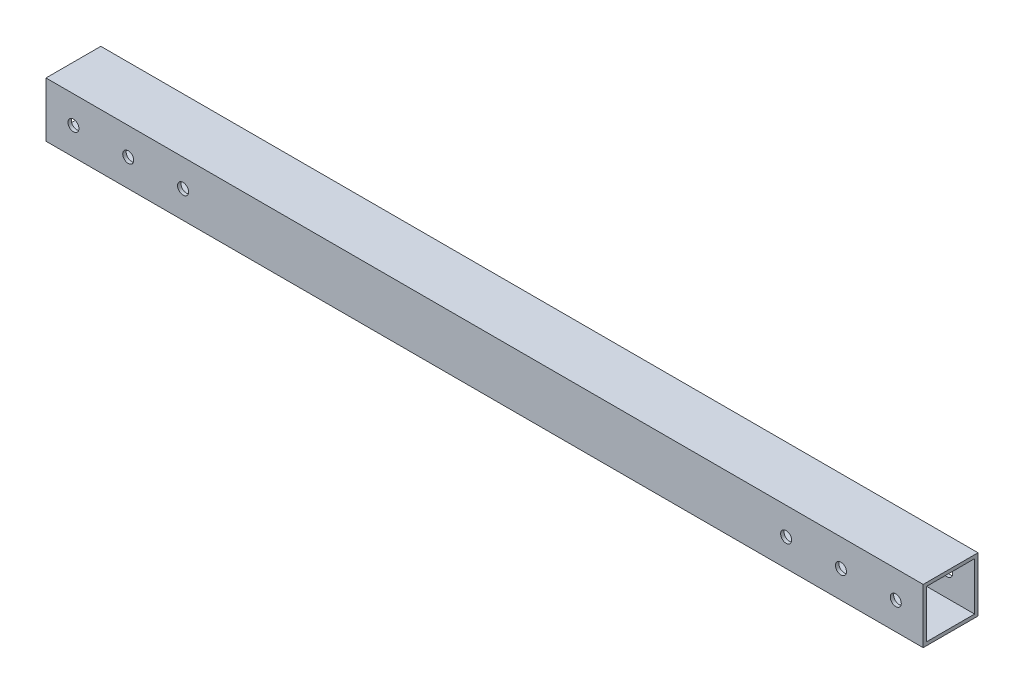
ISO-10303-21;
HEADER;
FILE_DESCRIPTION(('STEP AP214'),'2;1');
FILE_NAME('part.step','',(''),(''),'','','');
FILE_SCHEMA(('AUTOMOTIVE_DESIGN { 1 0 10303 214 1 1 1 1 }'));
ENDSEC;
DATA;
#1=APPLICATION_CONTEXT('core data for automotive mechanical design processes');
#2=APPLICATION_PROTOCOL_DEFINITION('international standard','automotive_design',2000,#1);
#3=PRODUCT_CONTEXT('',#1,'mechanical');
#4=PRODUCT('Part','Part','',(#3));
#5=PRODUCT_RELATED_PRODUCT_CATEGORY('part','',(#4));
#6=PRODUCT_DEFINITION_FORMATION('','',#4);
#7=PRODUCT_DEFINITION_CONTEXT('part definition',#1,'design');
#8=PRODUCT_DEFINITION('design','',#6,#7);
#9=PRODUCT_DEFINITION_SHAPE('','',#8);
#10=(LENGTH_UNIT() NAMED_UNIT(*) SI_UNIT(.MILLI.,.METRE.));
#11=(NAMED_UNIT(*) PLANE_ANGLE_UNIT() SI_UNIT($,.RADIAN.));
#12=(NAMED_UNIT(*) SI_UNIT($,.STERADIAN.) SOLID_ANGLE_UNIT());
#13=UNCERTAINTY_MEASURE_WITH_UNIT(LENGTH_MEASURE(1.E-05),#10,'distance_accuracy_value','');
#14=(GEOMETRIC_REPRESENTATION_CONTEXT(3) GLOBAL_UNCERTAINTY_ASSIGNED_CONTEXT((#13)) GLOBAL_UNIT_ASSIGNED_CONTEXT((#10,
#11,#12)) REPRESENTATION_CONTEXT('',''));
#15=CARTESIAN_POINT('',(0.,0.,0.));
#16=DIRECTION('',(0.,0.,1.));
#17=DIRECTION('',(1.,0.,0.));
#18=AXIS2_PLACEMENT_3D('',#15,#16,#17);
#19=CARTESIAN_POINT('',(-203.2,-12.7,-12.7));
#20=DIRECTION('',(0.,0.,-1.));
#21=DIRECTION('',(-1.,0.,0.));
#22=AXIS2_PLACEMENT_3D('',#19,#20,#21);
#23=PLANE('',#22);
#24=CARTESIAN_POINT('',(190.5,0.,-12.7));
#25=DIRECTION('',(0.,0.,1.));
#26=DIRECTION('',(1.,0.,0.));
#27=AXIS2_PLACEMENT_3D('',#24,#25,#26);
#28=CIRCLE('',#27,2.55269999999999);
#29=CARTESIAN_POINT('',(193.0527,0.,-12.7));
#30=VERTEX_POINT('',#29);
#31=EDGE_CURVE('E259',#30,#30,#28,.T.);
#32=ORIENTED_EDGE('',*,*,#31,.T.);
#33=EDGE_LOOP('',(#32));
#34=FACE_BOUND('',#33,.T.);
#35=CARTESIAN_POINT('',(165.1,-1.77367252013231E-13,-12.7));
#36=DIRECTION('',(0.,0.,1.));
#37=DIRECTION('',(1.,0.,0.));
#38=AXIS2_PLACEMENT_3D('',#35,#36,#37);
#39=CIRCLE('',#38,2.55269999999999);
#40=CARTESIAN_POINT('',(167.6527,-1.77367252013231E-13,-12.7));
#41=VERTEX_POINT('',#40);
#42=EDGE_CURVE('E184',#41,#41,#39,.T.);
#43=ORIENTED_EDGE('',*,*,#42,.T.);
#44=EDGE_LOOP('',(#43));
#45=FACE_BOUND('',#44,.T.);
#46=CARTESIAN_POINT('',(139.7,-3.54734504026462E-13,-12.7));
#47=DIRECTION('',(0.,0.,1.));
#48=DIRECTION('',(1.,0.,0.));
#49=AXIS2_PLACEMENT_3D('',#46,#47,#48);
#50=CIRCLE('',#49,2.55269999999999);
#51=CARTESIAN_POINT('',(142.2527,-3.54734504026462E-13,-12.7));
#52=VERTEX_POINT('',#51);
#53=EDGE_CURVE('E180',#52,#52,#50,.T.);
#54=ORIENTED_EDGE('',*,*,#53,.T.);
#55=EDGE_LOOP('',(#54));
#56=FACE_BOUND('',#55,.T.);
#57=CARTESIAN_POINT('',(-139.7,-2.30577427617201E-12,-12.7));
#58=DIRECTION('',(0.,0.,1.));
#59=DIRECTION('',(1.,0.,0.));
#60=AXIS2_PLACEMENT_3D('',#57,#58,#59);
#61=CIRCLE('',#60,2.55269999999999);
#62=CARTESIAN_POINT('',(-137.1473,-2.30577427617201E-12,-12.7));
#63=VERTEX_POINT('',#62);
#64=EDGE_CURVE('E176',#63,#63,#61,.T.);
#65=ORIENTED_EDGE('',*,*,#64,.T.);
#66=EDGE_LOOP('',(#65));
#67=FACE_BOUND('',#66,.T.);
#68=CARTESIAN_POINT('',(-165.1,-2.48314152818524E-12,-12.7));
#69=DIRECTION('',(0.,0.,1.));
#70=DIRECTION('',(1.,0.,0.));
#71=AXIS2_PLACEMENT_3D('',#68,#69,#70);
#72=CIRCLE('',#71,2.55269999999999);
#73=CARTESIAN_POINT('',(-162.5473,-2.48314152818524E-12,-12.7));
#74=VERTEX_POINT('',#73);
#75=EDGE_CURVE('E171',#74,#74,#72,.T.);
#76=ORIENTED_EDGE('',*,*,#75,.T.);
#77=EDGE_LOOP('',(#76));
#78=FACE_BOUND('',#77,.T.);
#79=CARTESIAN_POINT('',(-190.5,-2.66050878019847E-12,-12.7));
#80=DIRECTION('',(0.,0.,1.));
#81=DIRECTION('',(1.,0.,0.));
#82=AXIS2_PLACEMENT_3D('',#79,#80,#81);
#83=CIRCLE('',#82,2.55269999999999);
#84=CARTESIAN_POINT('',(-187.9473,-2.66050878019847E-12,-12.7));
#85=VERTEX_POINT('',#84);
#86=EDGE_CURVE('E223',#85,#85,#83,.T.);
#87=ORIENTED_EDGE('',*,*,#86,.T.);
#88=EDGE_LOOP('',(#87));
#89=FACE_BOUND('',#88,.T.);
#90=DIRECTION('',(1.,0.,0.));
#91=VECTOR('',#90,1.);
#92=CARTESIAN_POINT('',(-203.2,12.7,-12.7));
#93=LINE('',#92,#91);
#94=CARTESIAN_POINT('',(-203.2,12.7,-12.7));
#95=VERTEX_POINT('',#94);
#96=CARTESIAN_POINT('',(203.2,12.7,-12.7));
#97=VERTEX_POINT('',#96);
#98=EDGE_CURVE('E161',#95,#97,#93,.T.);
#99=ORIENTED_EDGE('',*,*,#98,.T.);
#100=DIRECTION('',(0.,1.,0.));
#101=VECTOR('',#100,1.);
#102=CARTESIAN_POINT('',(203.2,-12.7,-12.7));
#103=LINE('',#102,#101);
#104=CARTESIAN_POINT('',(203.2,-12.7,-12.7));
#105=VERTEX_POINT('',#104);
#106=EDGE_CURVE('E129',#105,#97,#103,.T.);
#107=ORIENTED_EDGE('',*,*,#106,.F.);
#108=DIRECTION('',(1.,0.,0.));
#109=VECTOR('',#108,1.);
#110=CARTESIAN_POINT('',(-203.2,-12.7,-12.7));
#111=LINE('',#110,#109);
#112=CARTESIAN_POINT('',(-203.2,-12.7,-12.7));
#113=VERTEX_POINT('',#112);
#114=EDGE_CURVE('E11',#113,#105,#111,.T.);
#115=ORIENTED_EDGE('',*,*,#114,.F.);
#116=DIRECTION('',(0.,1.,0.));
#117=VECTOR('',#116,1.);
#118=CARTESIAN_POINT('',(-203.2,-12.7,-12.7));
#119=LINE('',#118,#117);
#120=EDGE_CURVE('E148',#113,#95,#119,.T.);
#121=ORIENTED_EDGE('',*,*,#120,.T.);
#122=EDGE_LOOP('',(#99,#107,#115,#121));
#123=FACE_BOUND('',#122,.T.);
#124=ADVANCED_FACE('F32',(#34,#45,#56,#67,#78,#89,#123),#23,.T.);
#125=CARTESIAN_POINT('',(-203.2,-12.7,12.7));
#126=DIRECTION('',(0.,-1.,0.));
#127=DIRECTION('',(0.,0.,-1.));
#128=AXIS2_PLACEMENT_3D('',#125,#126,#127);
#129=PLANE('',#128);
#130=ORIENTED_EDGE('',*,*,#114,.T.);
#131=DIRECTION('',(0.,0.,-1.));
#132=VECTOR('',#131,1.);
#133=CARTESIAN_POINT('',(203.2,-12.7,12.7));
#134=LINE('',#133,#132);
#135=CARTESIAN_POINT('',(203.2,-12.7,12.7));
#136=VERTEX_POINT('',#135);
#137=EDGE_CURVE('E138',#136,#105,#134,.T.);
#138=ORIENTED_EDGE('',*,*,#137,.F.);
#139=DIRECTION('',(1.,0.,0.));
#140=VECTOR('',#139,1.);
#141=CARTESIAN_POINT('',(-203.2,-12.7,12.7));
#142=LINE('',#141,#140);
#143=CARTESIAN_POINT('',(-203.2,-12.7,12.7));
#144=VERTEX_POINT('',#143);
#145=EDGE_CURVE('E40',#144,#136,#142,.T.);
#146=ORIENTED_EDGE('',*,*,#145,.F.);
#147=DIRECTION('',(0.,0.,-1.));
#148=VECTOR('',#147,1.);
#149=CARTESIAN_POINT('',(-203.2,-12.7,12.7));
#150=LINE('',#149,#148);
#151=EDGE_CURVE('E159',#144,#113,#150,.T.);
#152=ORIENTED_EDGE('',*,*,#151,.T.);
#153=EDGE_LOOP('',(#130,#138,#146,#152));
#154=FACE_BOUND('',#153,.T.);
#155=ADVANCED_FACE('F249',(#154),#129,.T.);
#156=CARTESIAN_POINT('',(-203.2,-12.7,12.7));
#157=DIRECTION('',(0.,0.,1.));
#158=DIRECTION('',(1.,0.,0.));
#159=AXIS2_PLACEMENT_3D('',#156,#157,#158);
#160=PLANE('',#159);
#161=CARTESIAN_POINT('',(190.5,0.,12.7));
#162=DIRECTION('',(0.,0.,1.));
#163=DIRECTION('',(1.,0.,0.));
#164=AXIS2_PLACEMENT_3D('',#161,#162,#163);
#165=CIRCLE('',#164,2.55269999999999);
#166=CARTESIAN_POINT('',(193.0527,0.,12.7));
#167=VERTEX_POINT('',#166);
#168=EDGE_CURVE('E420',#167,#167,#165,.T.);
#169=ORIENTED_EDGE('',*,*,#168,.F.);
#170=EDGE_LOOP('',(#169));
#171=FACE_BOUND('',#170,.T.);
#172=CARTESIAN_POINT('',(165.1,-1.77367252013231E-13,12.7));
#173=DIRECTION('',(0.,0.,1.));
#174=DIRECTION('',(1.,0.,0.));
#175=AXIS2_PLACEMENT_3D('',#172,#173,#174);
#176=CIRCLE('',#175,2.55269999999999);
#177=CARTESIAN_POINT('',(167.6527,-1.77367252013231E-13,12.7));
#178=VERTEX_POINT('',#177);
#179=EDGE_CURVE('E191',#178,#178,#176,.T.);
#180=ORIENTED_EDGE('',*,*,#179,.F.);
#181=EDGE_LOOP('',(#180));
#182=FACE_BOUND('',#181,.T.);
#183=CARTESIAN_POINT('',(139.7,-3.54734504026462E-13,12.7));
#184=DIRECTION('',(0.,0.,1.));
#185=DIRECTION('',(1.,0.,0.));
#186=AXIS2_PLACEMENT_3D('',#183,#184,#185);
#187=CIRCLE('',#186,2.55269999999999);
#188=CARTESIAN_POINT('',(142.2527,-3.54734504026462E-13,12.7));
#189=VERTEX_POINT('',#188);
#190=EDGE_CURVE('E188',#189,#189,#187,.T.);
#191=ORIENTED_EDGE('',*,*,#190,.F.);
#192=EDGE_LOOP('',(#191));
#193=FACE_BOUND('',#192,.T.);
#194=CARTESIAN_POINT('',(-139.7,-2.30577427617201E-12,12.7));
#195=DIRECTION('',(0.,0.,1.));
#196=DIRECTION('',(1.,0.,0.));
#197=AXIS2_PLACEMENT_3D('',#194,#195,#196);
#198=CIRCLE('',#197,2.55269999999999);
#199=CARTESIAN_POINT('',(-137.1473,-2.30577427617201E-12,12.7));
#200=VERTEX_POINT('',#199);
#201=EDGE_CURVE('E206',#200,#200,#198,.T.);
#202=ORIENTED_EDGE('',*,*,#201,.F.);
#203=EDGE_LOOP('',(#202));
#204=FACE_BOUND('',#203,.T.);
#205=CARTESIAN_POINT('',(-165.1,-2.48314152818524E-12,12.7));
#206=DIRECTION('',(0.,0.,1.));
#207=DIRECTION('',(1.,0.,0.));
#208=AXIS2_PLACEMENT_3D('',#205,#206,#207);
#209=CIRCLE('',#208,2.55269999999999);
#210=CARTESIAN_POINT('',(-162.5473,-2.48314152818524E-12,12.7));
#211=VERTEX_POINT('',#210);
#212=EDGE_CURVE('E213',#211,#211,#209,.T.);
#213=ORIENTED_EDGE('',*,*,#212,.F.);
#214=EDGE_LOOP('',(#213));
#215=FACE_BOUND('',#214,.T.);
#216=CARTESIAN_POINT('',(-190.5,-2.66050878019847E-12,12.7));
#217=DIRECTION('',(0.,0.,1.));
#218=DIRECTION('',(1.,0.,0.));
#219=AXIS2_PLACEMENT_3D('',#216,#217,#218);
#220=CIRCLE('',#219,2.55269999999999);
#221=CARTESIAN_POINT('',(-187.9473,-2.66050878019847E-12,12.7));
#222=VERTEX_POINT('',#221);
#223=EDGE_CURVE('E220',#222,#222,#220,.T.);
#224=ORIENTED_EDGE('',*,*,#223,.F.);
#225=EDGE_LOOP('',(#224));
#226=FACE_BOUND('',#225,.T.);
#227=ORIENTED_EDGE('',*,*,#145,.T.);
#228=DIRECTION('',(0.,-1.,0.));
#229=VECTOR('',#228,1.);
#230=CARTESIAN_POINT('',(203.2,-12.7,12.7));
#231=LINE('',#230,#229);
#232=CARTESIAN_POINT('',(203.2,12.7,12.7));
#233=VERTEX_POINT('',#232);
#234=EDGE_CURVE('E135',#233,#136,#231,.T.);
#235=ORIENTED_EDGE('',*,*,#234,.F.);
#236=DIRECTION('',(1.,0.,0.));
#237=VECTOR('',#236,1.);
#238=CARTESIAN_POINT('',(-203.2,12.7,12.7));
#239=LINE('',#238,#237);
#240=CARTESIAN_POINT('',(-203.2,12.7,12.7));
#241=VERTEX_POINT('',#240);
#242=EDGE_CURVE('E164',#241,#233,#239,.T.);
#243=ORIENTED_EDGE('',*,*,#242,.F.);
#244=DIRECTION('',(0.,-1.,0.));
#245=VECTOR('',#244,1.);
#246=CARTESIAN_POINT('',(-203.2,-12.7,12.7));
#247=LINE('',#246,#245);
#248=EDGE_CURVE('E156',#241,#144,#247,.T.);
#249=ORIENTED_EDGE('',*,*,#248,.T.);
#250=EDGE_LOOP('',(#227,#235,#243,#249));
#251=FACE_BOUND('',#250,.T.);
#252=ADVANCED_FACE('F254',(#171,#182,#193,#204,#215,#226,#251),#160,.T.);
#253=CARTESIAN_POINT('',(-203.2,12.7,12.7));
#254=DIRECTION('',(0.,1.,0.));
#255=DIRECTION('',(0.,0.,1.));
#256=AXIS2_PLACEMENT_3D('',#253,#254,#255);
#257=PLANE('',#256);
#258=ORIENTED_EDGE('',*,*,#242,.T.);
#259=DIRECTION('',(0.,0.,1.));
#260=VECTOR('',#259,1.);
#261=CARTESIAN_POINT('',(203.2,12.7,12.7));
#262=LINE('',#261,#260);
#263=EDGE_CURVE('E132',#97,#233,#262,.T.);
#264=ORIENTED_EDGE('',*,*,#263,.F.);
#265=ORIENTED_EDGE('',*,*,#98,.F.);
#266=DIRECTION('',(0.,0.,1.));
#267=VECTOR('',#266,1.);
#268=CARTESIAN_POINT('',(-203.2,12.7,12.7));
#269=LINE('',#268,#267);
#270=EDGE_CURVE('E153',#95,#241,#269,.T.);
#271=ORIENTED_EDGE('',*,*,#270,.T.);
#272=EDGE_LOOP('',(#258,#264,#265,#271));
#273=FACE_BOUND('',#272,.T.);
#274=ADVANCED_FACE('F270',(#273),#257,.T.);
#275=CARTESIAN_POINT('',(-203.2,0.,0.));
#276=DIRECTION('',(-1.,0.,0.));
#277=DIRECTION('',(0.,0.,1.));
#278=AXIS2_PLACEMENT_3D('',#275,#276,#277);
#279=PLANE('',#278);
#280=DIRECTION('',(0.,1.,0.));
#281=VECTOR('',#280,1.);
#282=CARTESIAN_POINT('',(-203.2,-11.1125,-11.1125));
#283=LINE('',#282,#281);
#284=CARTESIAN_POINT('',(-203.2,-11.1125,-11.1125));
#285=VERTEX_POINT('',#284);
#286=CARTESIAN_POINT('',(-203.2,11.1125,-11.1125));
#287=VERTEX_POINT('',#286);
#288=EDGE_CURVE('E141',#285,#287,#283,.T.);
#289=ORIENTED_EDGE('',*,*,#288,.T.);
#290=DIRECTION('',(0.,0.,1.));
#291=VECTOR('',#290,1.);
#292=CARTESIAN_POINT('',(-203.2,11.1125,11.1125));
#293=LINE('',#292,#291);
#294=CARTESIAN_POINT('',(-203.2,11.1125,11.1125));
#295=VERTEX_POINT('',#294);
#296=EDGE_CURVE('E104',#287,#295,#293,.T.);
#297=ORIENTED_EDGE('',*,*,#296,.T.);
#298=DIRECTION('',(0.,-1.,0.));
#299=VECTOR('',#298,1.);
#300=CARTESIAN_POINT('',(-203.2,-11.1125,11.1125));
#301=LINE('',#300,#299);
#302=CARTESIAN_POINT('',(-203.2,-11.1125,11.1125));
#303=VERTEX_POINT('',#302);
#304=EDGE_CURVE('E48',#295,#303,#301,.T.);
#305=ORIENTED_EDGE('',*,*,#304,.T.);
#306=DIRECTION('',(0.,0.,-1.));
#307=VECTOR('',#306,1.);
#308=CARTESIAN_POINT('',(-203.2,-11.1125,11.1125));
#309=LINE('',#308,#307);
#310=EDGE_CURVE('E109',#303,#285,#309,.T.);
#311=ORIENTED_EDGE('',*,*,#310,.T.);
#312=EDGE_LOOP('',(#289,#297,#305,#311));
#313=FACE_BOUND('',#312,.T.);
#314=ORIENTED_EDGE('',*,*,#120,.F.);
#315=ORIENTED_EDGE('',*,*,#151,.F.);
#316=ORIENTED_EDGE('',*,*,#248,.F.);
#317=ORIENTED_EDGE('',*,*,#270,.F.);
#318=EDGE_LOOP('',(#314,#315,#316,#317));
#319=FACE_BOUND('',#318,.T.);
#320=ADVANCED_FACE('F277',(#313,#319),#279,.T.);
#321=CARTESIAN_POINT('',(-203.2,-11.1125,-11.1125));
#322=DIRECTION('',(0.,0.,-1.));
#323=DIRECTION('',(-1.,0.,0.));
#324=AXIS2_PLACEMENT_3D('',#321,#322,#323);
#325=PLANE('',#324);
#326=CARTESIAN_POINT('',(190.5,0.,-11.1125));
#327=DIRECTION('',(0.,0.,-1.));
#328=DIRECTION('',(-1.,0.,0.));
#329=AXIS2_PLACEMENT_3D('',#326,#327,#328);
#330=CIRCLE('',#329,2.55269999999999);
#331=CARTESIAN_POINT('',(187.9473,0.,-11.1125));
#332=VERTEX_POINT('',#331);
#333=EDGE_CURVE('E196',#332,#332,#330,.T.);
#334=ORIENTED_EDGE('',*,*,#333,.T.);
#335=EDGE_LOOP('',(#334));
#336=FACE_BOUND('',#335,.T.);
#337=CARTESIAN_POINT('',(165.1,-1.77367252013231E-13,-11.1125));
#338=DIRECTION('',(0.,0.,-1.));
#339=DIRECTION('',(-1.,0.,0.));
#340=AXIS2_PLACEMENT_3D('',#337,#338,#339);
#341=CIRCLE('',#340,2.55269999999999);
#342=CARTESIAN_POINT('',(162.5473,-1.77367252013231E-13,-11.1125));
#343=VERTEX_POINT('',#342);
#344=EDGE_CURVE('E181',#343,#343,#341,.T.);
#345=ORIENTED_EDGE('',*,*,#344,.T.);
#346=EDGE_LOOP('',(#345));
#347=FACE_BOUND('',#346,.T.);
#348=CARTESIAN_POINT('',(139.7,-3.54734504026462E-13,-11.1125));
#349=DIRECTION('',(0.,0.,-1.));
#350=DIRECTION('',(-1.,0.,0.));
#351=AXIS2_PLACEMENT_3D('',#348,#349,#350);
#352=CIRCLE('',#351,2.55269999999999);
#353=CARTESIAN_POINT('',(137.1473,-3.54734504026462E-13,-11.1125));
#354=VERTEX_POINT('',#353);
#355=EDGE_CURVE('E179',#354,#354,#352,.T.);
#356=ORIENTED_EDGE('',*,*,#355,.T.);
#357=EDGE_LOOP('',(#356));
#358=FACE_BOUND('',#357,.T.);
#359=CARTESIAN_POINT('',(-139.7,-2.30577427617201E-12,-11.1125));
#360=DIRECTION('',(0.,0.,-1.));
#361=DIRECTION('',(-1.,0.,0.));
#362=AXIS2_PLACEMENT_3D('',#359,#360,#361);
#363=CIRCLE('',#362,2.55269999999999);
#364=CARTESIAN_POINT('',(-142.2527,-2.30577427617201E-12,-11.1125));
#365=VERTEX_POINT('',#364);
#366=EDGE_CURVE('E172',#365,#365,#363,.T.);
#367=ORIENTED_EDGE('',*,*,#366,.T.);
#368=EDGE_LOOP('',(#367));
#369=FACE_BOUND('',#368,.T.);
#370=CARTESIAN_POINT('',(-165.1,-2.48314152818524E-12,-11.1125));
#371=DIRECTION('',(0.,0.,-1.));
#372=DIRECTION('',(-1.,0.,0.));
#373=AXIS2_PLACEMENT_3D('',#370,#371,#372);
#374=CIRCLE('',#373,2.55269999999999);
#375=CARTESIAN_POINT('',(-167.6527,-2.48314152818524E-12,-11.1125));
#376=VERTEX_POINT('',#375);
#377=EDGE_CURVE('E170',#376,#376,#374,.T.);
#378=ORIENTED_EDGE('',*,*,#377,.T.);
#379=EDGE_LOOP('',(#378));
#380=FACE_BOUND('',#379,.T.);
#381=CARTESIAN_POINT('',(-190.5,-2.66050878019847E-12,-11.1125));
#382=DIRECTION('',(0.,0.,-1.));
#383=DIRECTION('',(-1.,0.,0.));
#384=AXIS2_PLACEMENT_3D('',#381,#382,#383);
#385=CIRCLE('',#384,2.55269999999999);
#386=CARTESIAN_POINT('',(-193.0527,-2.66050878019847E-12,-11.1125));
#387=VERTEX_POINT('',#386);
#388=EDGE_CURVE('E118',#387,#387,#385,.T.);
#389=ORIENTED_EDGE('',*,*,#388,.T.);
#390=EDGE_LOOP('',(#389));
#391=FACE_BOUND('',#390,.T.);
#392=DIRECTION('',(1.,0.,0.));
#393=VECTOR('',#392,1.);
#394=CARTESIAN_POINT('',(-203.2,-11.1125,-11.1125));
#395=LINE('',#394,#393);
#396=CARTESIAN_POINT('',(203.2,-11.1125,-11.1125));
#397=VERTEX_POINT('',#396);
#398=EDGE_CURVE('E114',#285,#397,#395,.T.);
#399=ORIENTED_EDGE('',*,*,#398,.T.);
#400=DIRECTION('',(0.,1.,0.));
#401=VECTOR('',#400,1.);
#402=CARTESIAN_POINT('',(203.2,-11.1125,-11.1125));
#403=LINE('',#402,#401);
#404=CARTESIAN_POINT('',(203.2,11.1125,-11.1125));
#405=VERTEX_POINT('',#404);
#406=EDGE_CURVE('E112',#397,#405,#403,.T.);
#407=ORIENTED_EDGE('',*,*,#406,.T.);
#408=DIRECTION('',(1.,0.,0.));
#409=VECTOR('',#408,1.);
#410=CARTESIAN_POINT('',(-203.2,11.1125,-11.1125));
#411=LINE('',#410,#409);
#412=EDGE_CURVE('E97',#287,#405,#411,.T.);
#413=ORIENTED_EDGE('',*,*,#412,.F.);
#414=ORIENTED_EDGE('',*,*,#288,.F.);
#415=EDGE_LOOP('',(#399,#407,#413,#414));
#416=FACE_BOUND('',#415,.T.);
#417=ADVANCED_FACE('F113',(#336,#347,#358,#369,#380,#391,#416),#325,.F.);
#418=CARTESIAN_POINT('',(-203.2,-11.1125,11.1125));
#419=DIRECTION('',(0.,-1.,0.));
#420=DIRECTION('',(0.,0.,-1.));
#421=AXIS2_PLACEMENT_3D('',#418,#419,#420);
#422=PLANE('',#421);
#423=DIRECTION('',(1.,0.,0.));
#424=VECTOR('',#423,1.);
#425=CARTESIAN_POINT('',(-203.2,-11.1125,11.1125));
#426=LINE('',#425,#424);
#427=CARTESIAN_POINT('',(203.2,-11.1125,11.1125));
#428=VERTEX_POINT('',#427);
#429=EDGE_CURVE('E149',#303,#428,#426,.T.);
#430=ORIENTED_EDGE('',*,*,#429,.T.);
#431=DIRECTION('',(0.,0.,-1.));
#432=VECTOR('',#431,1.);
#433=CARTESIAN_POINT('',(203.2,-11.1125,11.1125));
#434=LINE('',#433,#432);
#435=EDGE_CURVE('E124',#428,#397,#434,.T.);
#436=ORIENTED_EDGE('',*,*,#435,.T.);
#437=ORIENTED_EDGE('',*,*,#398,.F.);
#438=ORIENTED_EDGE('',*,*,#310,.F.);
#439=EDGE_LOOP('',(#430,#436,#437,#438));
#440=FACE_BOUND('',#439,.T.);
#441=ADVANCED_FACE('F293',(#440),#422,.F.);
#442=CARTESIAN_POINT('',(-203.2,-11.1125,11.1125));
#443=DIRECTION('',(0.,0.,1.));
#444=DIRECTION('',(1.,0.,0.));
#445=AXIS2_PLACEMENT_3D('',#442,#443,#444);
#446=PLANE('',#445);
#447=CARTESIAN_POINT('',(190.5,0.,11.1125));
#448=DIRECTION('',(0.,0.,1.));
#449=DIRECTION('',(1.,0.,0.));
#450=AXIS2_PLACEMENT_3D('',#447,#448,#449);
#451=CIRCLE('',#450,2.55269999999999);
#452=CARTESIAN_POINT('',(193.0527,0.,11.1125));
#453=VERTEX_POINT('',#452);
#454=EDGE_CURVE('E35',#453,#453,#451,.T.);
#455=ORIENTED_EDGE('',*,*,#454,.T.);
#456=EDGE_LOOP('',(#455));
#457=FACE_BOUND('',#456,.T.);
#458=CARTESIAN_POINT('',(165.1,-1.77367252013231E-13,11.1125));
#459=DIRECTION('',(0.,0.,1.));
#460=DIRECTION('',(1.,0.,0.));
#461=AXIS2_PLACEMENT_3D('',#458,#459,#460);
#462=CIRCLE('',#461,2.55269999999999);
#463=CARTESIAN_POINT('',(167.6527,-1.77367252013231E-13,11.1125));
#464=VERTEX_POINT('',#463);
#465=EDGE_CURVE('E183',#464,#464,#462,.T.);
#466=ORIENTED_EDGE('',*,*,#465,.T.);
#467=EDGE_LOOP('',(#466));
#468=FACE_BOUND('',#467,.T.);
#469=CARTESIAN_POINT('',(139.7,-3.54734504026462E-13,11.1125));
#470=DIRECTION('',(0.,0.,1.));
#471=DIRECTION('',(1.,0.,0.));
#472=AXIS2_PLACEMENT_3D('',#469,#470,#471);
#473=CIRCLE('',#472,2.55269999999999);
#474=CARTESIAN_POINT('',(142.2527,-3.54734504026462E-13,11.1125));
#475=VERTEX_POINT('',#474);
#476=EDGE_CURVE('E177',#475,#475,#473,.T.);
#477=ORIENTED_EDGE('',*,*,#476,.T.);
#478=EDGE_LOOP('',(#477));
#479=FACE_BOUND('',#478,.T.);
#480=CARTESIAN_POINT('',(-139.7,-2.30577427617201E-12,11.1125));
#481=DIRECTION('',(0.,0.,1.));
#482=DIRECTION('',(1.,0.,0.));
#483=AXIS2_PLACEMENT_3D('',#480,#481,#482);
#484=CIRCLE('',#483,2.55269999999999);
#485=CARTESIAN_POINT('',(-137.1473,-2.30577427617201E-12,11.1125));
#486=VERTEX_POINT('',#485);
#487=EDGE_CURVE('E175',#486,#486,#484,.T.);
#488=ORIENTED_EDGE('',*,*,#487,.T.);
#489=EDGE_LOOP('',(#488));
#490=FACE_BOUND('',#489,.T.);
#491=CARTESIAN_POINT('',(-165.1,-2.48314152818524E-12,11.1125));
#492=DIRECTION('',(0.,0.,1.));
#493=DIRECTION('',(1.,0.,0.));
#494=AXIS2_PLACEMENT_3D('',#491,#492,#493);
#495=CIRCLE('',#494,2.55269999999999);
#496=CARTESIAN_POINT('',(-162.5473,-2.48314152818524E-12,11.1125));
#497=VERTEX_POINT('',#496);
#498=EDGE_CURVE('E167',#497,#497,#495,.T.);
#499=ORIENTED_EDGE('',*,*,#498,.T.);
#500=EDGE_LOOP('',(#499));
#501=FACE_BOUND('',#500,.T.);
#502=CARTESIAN_POINT('',(-190.5,-2.66050878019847E-12,11.1125));
#503=DIRECTION('',(0.,0.,1.));
#504=DIRECTION('',(1.,0.,0.));
#505=AXIS2_PLACEMENT_3D('',#502,#503,#504);
#506=CIRCLE('',#505,2.55269999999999);
#507=CARTESIAN_POINT('',(-187.9473,-2.66050878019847E-12,11.1125));
#508=VERTEX_POINT('',#507);
#509=EDGE_CURVE('E226',#508,#508,#506,.T.);
#510=ORIENTED_EDGE('',*,*,#509,.T.);
#511=EDGE_LOOP('',(#510));
#512=FACE_BOUND('',#511,.T.);
#513=DIRECTION('',(1.,0.,0.));
#514=VECTOR('',#513,1.);
#515=CARTESIAN_POINT('',(-203.2,11.1125,11.1125));
#516=LINE('',#515,#514);
#517=CARTESIAN_POINT('',(203.2,11.1125,11.1125));
#518=VERTEX_POINT('',#517);
#519=EDGE_CURVE('E108',#295,#518,#516,.T.);
#520=ORIENTED_EDGE('',*,*,#519,.T.);
#521=DIRECTION('',(0.,-1.,0.));
#522=VECTOR('',#521,1.);
#523=CARTESIAN_POINT('',(203.2,-11.1125,11.1125));
#524=LINE('',#523,#522);
#525=EDGE_CURVE('E122',#518,#428,#524,.T.);
#526=ORIENTED_EDGE('',*,*,#525,.T.);
#527=ORIENTED_EDGE('',*,*,#429,.F.);
#528=ORIENTED_EDGE('',*,*,#304,.F.);
#529=EDGE_LOOP('',(#520,#526,#527,#528));
#530=FACE_BOUND('',#529,.T.);
#531=ADVANCED_FACE('F297',(#457,#468,#479,#490,#501,#512,#530),#446,.F.);
#532=CARTESIAN_POINT('',(-203.2,11.1125,11.1125));
#533=DIRECTION('',(0.,1.,0.));
#534=DIRECTION('',(0.,0.,1.));
#535=AXIS2_PLACEMENT_3D('',#532,#533,#534);
#536=PLANE('',#535);
#537=ORIENTED_EDGE('',*,*,#412,.T.);
#538=DIRECTION('',(0.,0.,1.));
#539=VECTOR('',#538,1.);
#540=CARTESIAN_POINT('',(203.2,11.1125,11.1125));
#541=LINE('',#540,#539);
#542=EDGE_CURVE('E101',#405,#518,#541,.T.);
#543=ORIENTED_EDGE('',*,*,#542,.T.);
#544=ORIENTED_EDGE('',*,*,#519,.F.);
#545=ORIENTED_EDGE('',*,*,#296,.F.);
#546=EDGE_LOOP('',(#537,#543,#544,#545));
#547=FACE_BOUND('',#546,.T.);
#548=ADVANCED_FACE('F99',(#547),#536,.F.);
#549=CARTESIAN_POINT('',(203.2,0.,0.));
#550=DIRECTION('',(-1.,0.,0.));
#551=DIRECTION('',(0.,0.,1.));
#552=AXIS2_PLACEMENT_3D('',#549,#550,#551);
#553=PLANE('',#552);
#554=ORIENTED_EDGE('',*,*,#106,.T.);
#555=ORIENTED_EDGE('',*,*,#263,.T.);
#556=ORIENTED_EDGE('',*,*,#234,.T.);
#557=ORIENTED_EDGE('',*,*,#137,.T.);
#558=EDGE_LOOP('',(#554,#555,#556,#557));
#559=FACE_BOUND('',#558,.T.);
#560=ORIENTED_EDGE('',*,*,#406,.F.);
#561=ORIENTED_EDGE('',*,*,#435,.F.);
#562=ORIENTED_EDGE('',*,*,#525,.F.);
#563=ORIENTED_EDGE('',*,*,#542,.F.);
#564=EDGE_LOOP('',(#560,#561,#562,#563));
#565=FACE_BOUND('',#564,.T.);
#566=ADVANCED_FACE('F120',(#559,#565),#553,.F.);
#567=CARTESIAN_POINT('',(-190.5,-2.66050878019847E-12,12.7));
#568=DIRECTION('',(0.,0.,1.));
#569=DIRECTION('',(1.,0.,0.));
#570=AXIS2_PLACEMENT_3D('',#567,#568,#569);
#571=CYLINDRICAL_SURFACE('',#570,2.55269999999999);
#572=ORIENTED_EDGE('',*,*,#223,.T.);
#573=EDGE_LOOP('',(#572));
#574=FACE_BOUND('',#573,.T.);
#575=ORIENTED_EDGE('',*,*,#509,.F.);
#576=EDGE_LOOP('',(#575));
#577=FACE_BOUND('',#576,.T.);
#578=ADVANCED_FACE('F235',(#574,#577),#571,.F.);
#579=ORIENTED_EDGE('',*,*,#86,.F.);
#580=EDGE_LOOP('',(#579));
#581=FACE_BOUND('',#580,.T.);
#582=ORIENTED_EDGE('',*,*,#388,.F.);
#583=EDGE_LOOP('',(#582));
#584=FACE_BOUND('',#583,.T.);
#585=ADVANCED_FACE('F232',(#581,#584),#571,.F.);
#586=CARTESIAN_POINT('',(-165.1,-2.48314152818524E-12,12.7));
#587=DIRECTION('',(0.,0.,1.));
#588=DIRECTION('',(1.,0.,0.));
#589=AXIS2_PLACEMENT_3D('',#586,#587,#588);
#590=CYLINDRICAL_SURFACE('',#589,2.55269999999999);
#591=ORIENTED_EDGE('',*,*,#212,.T.);
#592=EDGE_LOOP('',(#591));
#593=FACE_BOUND('',#592,.T.);
#594=ORIENTED_EDGE('',*,*,#498,.F.);
#595=EDGE_LOOP('',(#594));
#596=FACE_BOUND('',#595,.T.);
#597=ADVANCED_FACE('F234',(#593,#596),#590,.F.);
#598=ORIENTED_EDGE('',*,*,#75,.F.);
#599=EDGE_LOOP('',(#598));
#600=FACE_BOUND('',#599,.T.);
#601=ORIENTED_EDGE('',*,*,#377,.F.);
#602=EDGE_LOOP('',(#601));
#603=FACE_BOUND('',#602,.T.);
#604=ADVANCED_FACE('F242',(#600,#603),#590,.F.);
#605=CARTESIAN_POINT('',(-139.7,-2.30577427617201E-12,12.7));
#606=DIRECTION('',(0.,0.,1.));
#607=DIRECTION('',(1.,0.,0.));
#608=AXIS2_PLACEMENT_3D('',#605,#606,#607);
#609=CYLINDRICAL_SURFACE('',#608,2.55269999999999);
#610=ORIENTED_EDGE('',*,*,#64,.F.);
#611=EDGE_LOOP('',(#610));
#612=FACE_BOUND('',#611,.T.);
#613=ORIENTED_EDGE('',*,*,#366,.F.);
#614=EDGE_LOOP('',(#613));
#615=FACE_BOUND('',#614,.T.);
#616=ADVANCED_FACE('F335',(#612,#615),#609,.F.);
#617=ORIENTED_EDGE('',*,*,#201,.T.);
#618=EDGE_LOOP('',(#617));
#619=FACE_BOUND('',#618,.T.);
#620=ORIENTED_EDGE('',*,*,#487,.F.);
#621=EDGE_LOOP('',(#620));
#622=FACE_BOUND('',#621,.T.);
#623=ADVANCED_FACE('F344',(#619,#622),#609,.F.);
#624=CARTESIAN_POINT('',(139.7,-3.54734504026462E-13,12.7));
#625=DIRECTION('',(0.,0.,1.));
#626=DIRECTION('',(1.,0.,0.));
#627=AXIS2_PLACEMENT_3D('',#624,#625,#626);
#628=CYLINDRICAL_SURFACE('',#627,2.55269999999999);
#629=ORIENTED_EDGE('',*,*,#190,.T.);
#630=EDGE_LOOP('',(#629));
#631=FACE_BOUND('',#630,.T.);
#632=ORIENTED_EDGE('',*,*,#476,.F.);
#633=EDGE_LOOP('',(#632));
#634=FACE_BOUND('',#633,.T.);
#635=ADVANCED_FACE('F354',(#631,#634),#628,.F.);
#636=ORIENTED_EDGE('',*,*,#53,.F.);
#637=EDGE_LOOP('',(#636));
#638=FACE_BOUND('',#637,.T.);
#639=ORIENTED_EDGE('',*,*,#355,.F.);
#640=EDGE_LOOP('',(#639));
#641=FACE_BOUND('',#640,.T.);
#642=ADVANCED_FACE('F363',(#638,#641),#628,.F.);
#643=CARTESIAN_POINT('',(165.1,-1.77367252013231E-13,12.7));
#644=DIRECTION('',(0.,0.,1.));
#645=DIRECTION('',(1.,0.,0.));
#646=AXIS2_PLACEMENT_3D('',#643,#644,#645);
#647=CYLINDRICAL_SURFACE('',#646,2.55269999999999);
#648=ORIENTED_EDGE('',*,*,#42,.F.);
#649=EDGE_LOOP('',(#648));
#650=FACE_BOUND('',#649,.T.);
#651=ORIENTED_EDGE('',*,*,#344,.F.);
#652=EDGE_LOOP('',(#651));
#653=FACE_BOUND('',#652,.T.);
#654=ADVANCED_FACE('F373',(#650,#653),#647,.F.);
#655=ORIENTED_EDGE('',*,*,#179,.T.);
#656=EDGE_LOOP('',(#655));
#657=FACE_BOUND('',#656,.T.);
#658=ORIENTED_EDGE('',*,*,#465,.F.);
#659=EDGE_LOOP('',(#658));
#660=FACE_BOUND('',#659,.T.);
#661=ADVANCED_FACE('F382',(#657,#660),#647,.F.);
#662=CARTESIAN_POINT('',(190.5,0.,12.7));
#663=DIRECTION('',(0.,0.,1.));
#664=DIRECTION('',(1.,0.,0.));
#665=AXIS2_PLACEMENT_3D('',#662,#663,#664);
#666=CYLINDRICAL_SURFACE('',#665,2.55269999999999);
#667=ORIENTED_EDGE('',*,*,#168,.T.);
#668=EDGE_LOOP('',(#667));
#669=FACE_BOUND('',#668,.T.);
#670=ORIENTED_EDGE('',*,*,#454,.F.);
#671=EDGE_LOOP('',(#670));
#672=FACE_BOUND('',#671,.T.);
#673=ADVANCED_FACE('F392',(#669,#672),#666,.F.);
#674=ORIENTED_EDGE('',*,*,#31,.F.);
#675=EDGE_LOOP('',(#674));
#676=FACE_BOUND('',#675,.T.);
#677=ORIENTED_EDGE('',*,*,#333,.F.);
#678=EDGE_LOOP('',(#677));
#679=FACE_BOUND('',#678,.T.);
#680=ADVANCED_FACE('F401',(#676,#679),#666,.F.);
#681=CLOSED_SHELL('',(#124,#155,#252,#274,#320,#417,#441,#531,#548,#566,#578,#585,#597,#604,
#616,#623,#635,#642,#654,#661,#673,#680));
#682=MANIFOLD_SOLID_BREP('B2',#681);
#683=ADVANCED_BREP_SHAPE_REPRESENTATION('',(#18,#682),#14);
#684=SHAPE_DEFINITION_REPRESENTATION(#9,#683);
ENDSEC;
END-ISO-10303-21;
